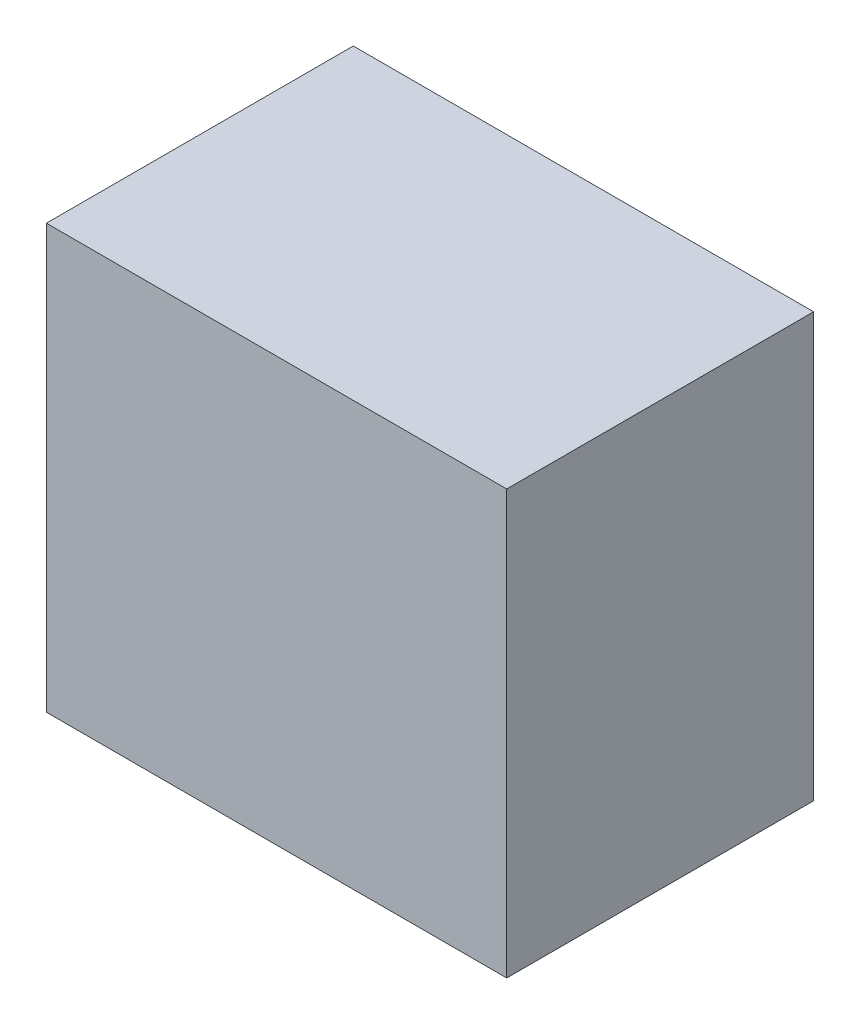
ISO-10303-21;
HEADER;
FILE_DESCRIPTION(('STEP AP214'),'2;1');
FILE_NAME('part.step','',(''),(''),'','','');
FILE_SCHEMA(('AUTOMOTIVE_DESIGN { 1 0 10303 214 1 1 1 1 }'));
ENDSEC;
DATA;
#1=APPLICATION_CONTEXT('core data for automotive mechanical design processes');
#2=APPLICATION_PROTOCOL_DEFINITION('international standard','automotive_design',2000,#1);
#3=PRODUCT_CONTEXT('',#1,'mechanical');
#4=PRODUCT('Part','Part','',(#3));
#5=PRODUCT_RELATED_PRODUCT_CATEGORY('part','',(#4));
#6=PRODUCT_DEFINITION_FORMATION('','',#4);
#7=PRODUCT_DEFINITION_CONTEXT('part definition',#1,'design');
#8=PRODUCT_DEFINITION('design','',#6,#7);
#9=PRODUCT_DEFINITION_SHAPE('','',#8);
#10=(LENGTH_UNIT() NAMED_UNIT(*) SI_UNIT(.MILLI.,.METRE.));
#11=(NAMED_UNIT(*) PLANE_ANGLE_UNIT() SI_UNIT($,.RADIAN.));
#12=(NAMED_UNIT(*) SI_UNIT($,.STERADIAN.) SOLID_ANGLE_UNIT());
#13=UNCERTAINTY_MEASURE_WITH_UNIT(LENGTH_MEASURE(1.E-05),#10,'distance_accuracy_value','');
#14=(GEOMETRIC_REPRESENTATION_CONTEXT(3) GLOBAL_UNCERTAINTY_ASSIGNED_CONTEXT((#13)) GLOBAL_UNIT_ASSIGNED_CONTEXT((#10,
#11,#12)) REPRESENTATION_CONTEXT('',''));
#15=CARTESIAN_POINT('',(0.,0.,0.));
#16=DIRECTION('',(0.,0.,1.));
#17=DIRECTION('',(1.,0.,0.));
#18=AXIS2_PLACEMENT_3D('',#15,#16,#17);
#19=CARTESIAN_POINT('',(0.,138.,-50.));
#20=DIRECTION('',(1.,0.,0.));
#21=DIRECTION('',(0.,0.,-1.));
#22=AXIS2_PLACEMENT_3D('',#19,#20,#21);
#23=PLANE('',#22);
#24=DIRECTION('',(0.,0.,1.));
#25=VECTOR('',#24,1.);
#26=CARTESIAN_POINT('',(0.,0.,-50.));
#27=LINE('',#26,#25);
#28=CARTESIAN_POINT('',(0.,0.,-50.));
#29=VERTEX_POINT('',#28);
#30=CARTESIAN_POINT('',(0.,0.,50.));
#31=VERTEX_POINT('',#30);
#32=EDGE_CURVE('E403',#29,#31,#27,.T.);
#33=ORIENTED_EDGE('',*,*,#32,.T.);
#34=DIRECTION('',(0.,-1.,0.));
#35=VECTOR('',#34,1.);
#36=CARTESIAN_POINT('',(0.,138.,50.));
#37=LINE('',#36,#35);
#38=CARTESIAN_POINT('',(0.,138.,50.));
#39=VERTEX_POINT('',#38);
#40=EDGE_CURVE('E11',#39,#31,#37,.T.);
#41=ORIENTED_EDGE('',*,*,#40,.F.);
#42=DIRECTION('',(0.,0.,1.));
#43=VECTOR('',#42,1.);
#44=CARTESIAN_POINT('',(0.,138.,-50.));
#45=LINE('',#44,#43);
#46=CARTESIAN_POINT('',(0.,138.,-50.));
#47=VERTEX_POINT('',#46);
#48=EDGE_CURVE('E421',#47,#39,#45,.T.);
#49=ORIENTED_EDGE('',*,*,#48,.F.);
#50=DIRECTION('',(0.,-1.,0.));
#51=VECTOR('',#50,1.);
#52=CARTESIAN_POINT('',(0.,138.,-50.));
#53=LINE('',#52,#51);
#54=EDGE_CURVE('E415',#47,#29,#53,.T.);
#55=ORIENTED_EDGE('',*,*,#54,.T.);
#56=EDGE_LOOP('',(#33,#41,#49,#55));
#57=FACE_BOUND('',#56,.T.);
#58=ADVANCED_FACE('F359',(#57),#23,.F.);
#59=CARTESIAN_POINT('',(0.,138.,50.));
#60=DIRECTION('',(0.,0.,-1.));
#61=DIRECTION('',(-1.,0.,0.));
#62=AXIS2_PLACEMENT_3D('',#59,#60,#61);
#63=PLANE('',#62);
#64=DIRECTION('',(1.,0.,0.));
#65=VECTOR('',#64,1.);
#66=CARTESIAN_POINT('',(0.,0.,50.));
#67=LINE('',#66,#65);
#68=CARTESIAN_POINT('',(150.,0.,50.));
#69=VERTEX_POINT('',#68);
#70=EDGE_CURVE('E399',#31,#69,#67,.T.);
#71=ORIENTED_EDGE('',*,*,#70,.T.);
#72=DIRECTION('',(0.,-1.,0.));
#73=VECTOR('',#72,1.);
#74=CARTESIAN_POINT('',(150.,138.,50.));
#75=LINE('',#74,#73);
#76=CARTESIAN_POINT('',(150.,138.,50.));
#77=VERTEX_POINT('',#76);
#78=EDGE_CURVE('E366',#77,#69,#75,.T.);
#79=ORIENTED_EDGE('',*,*,#78,.F.);
#80=DIRECTION('',(1.,0.,0.));
#81=VECTOR('',#80,1.);
#82=CARTESIAN_POINT('',(0.,138.,50.));
#83=LINE('',#82,#81);
#84=EDGE_CURVE('E411',#39,#77,#83,.T.);
#85=ORIENTED_EDGE('',*,*,#84,.F.);
#86=ORIENTED_EDGE('',*,*,#40,.T.);
#87=EDGE_LOOP('',(#71,#79,#85,#86));
#88=FACE_BOUND('',#87,.T.);
#89=ADVANCED_FACE('F410',(#88),#63,.F.);
#90=CARTESIAN_POINT('',(150.,138.,-50.));
#91=DIRECTION('',(-1.,0.,0.));
#92=DIRECTION('',(0.,0.,1.));
#93=AXIS2_PLACEMENT_3D('',#90,#91,#92);
#94=PLANE('',#93);
#95=DIRECTION('',(0.,0.,-1.));
#96=VECTOR('',#95,1.);
#97=CARTESIAN_POINT('',(150.,0.,-50.));
#98=LINE('',#97,#96);
#99=CARTESIAN_POINT('',(150.,0.,-50.));
#100=VERTEX_POINT('',#99);
#101=EDGE_CURVE('E404',#69,#100,#98,.T.);
#102=ORIENTED_EDGE('',*,*,#101,.T.);
#103=DIRECTION('',(0.,-1.,0.));
#104=VECTOR('',#103,1.);
#105=CARTESIAN_POINT('',(150.,138.,-50.));
#106=LINE('',#105,#104);
#107=CARTESIAN_POINT('',(150.,138.,-50.));
#108=VERTEX_POINT('',#107);
#109=EDGE_CURVE('E427',#108,#100,#106,.T.);
#110=ORIENTED_EDGE('',*,*,#109,.F.);
#111=DIRECTION('',(0.,0.,-1.));
#112=VECTOR('',#111,1.);
#113=CARTESIAN_POINT('',(150.,138.,-50.));
#114=LINE('',#113,#112);
#115=EDGE_CURVE('E378',#77,#108,#114,.T.);
#116=ORIENTED_EDGE('',*,*,#115,.F.);
#117=ORIENTED_EDGE('',*,*,#78,.T.);
#118=EDGE_LOOP('',(#102,#110,#116,#117));
#119=FACE_BOUND('',#118,.T.);
#120=ADVANCED_FACE('F430',(#119),#94,.F.);
#121=CARTESIAN_POINT('',(0.,138.,-50.));
#122=DIRECTION('',(0.,0.,1.));
#123=DIRECTION('',(1.,0.,0.));
#124=AXIS2_PLACEMENT_3D('',#121,#122,#123);
#125=PLANE('',#124);
#126=DIRECTION('',(-1.,0.,0.));
#127=VECTOR('',#126,1.);
#128=CARTESIAN_POINT('',(0.,0.,-50.));
#129=LINE('',#128,#127);
#130=EDGE_CURVE('E419',#100,#29,#129,.T.);
#131=ORIENTED_EDGE('',*,*,#130,.T.);
#132=ORIENTED_EDGE('',*,*,#54,.F.);
#133=DIRECTION('',(-1.,0.,0.));
#134=VECTOR('',#133,1.);
#135=CARTESIAN_POINT('',(0.,138.,-50.));
#136=LINE('',#135,#134);
#137=EDGE_CURVE('E373',#108,#47,#136,.T.);
#138=ORIENTED_EDGE('',*,*,#137,.F.);
#139=ORIENTED_EDGE('',*,*,#109,.T.);
#140=EDGE_LOOP('',(#131,#132,#138,#139));
#141=FACE_BOUND('',#140,.T.);
#142=ADVANCED_FACE('F432',(#141),#125,.F.);
#143=CARTESIAN_POINT('',(0.,138.,50.));
#144=DIRECTION('',(0.,1.,0.));
#145=DIRECTION('',(0.,0.,1.));
#146=AXIS2_PLACEMENT_3D('',#143,#144,#145);
#147=PLANE('',#146);
#148=ORIENTED_EDGE('',*,*,#48,.T.);
#149=ORIENTED_EDGE('',*,*,#84,.T.);
#150=ORIENTED_EDGE('',*,*,#115,.T.);
#151=ORIENTED_EDGE('',*,*,#137,.T.);
#152=EDGE_LOOP('',(#148,#149,#150,#151));
#153=FACE_BOUND('',#152,.T.);
#154=ADVANCED_FACE('F433',(#153),#147,.T.);
#155=CARTESIAN_POINT('',(0.,0.,50.));
#156=DIRECTION('',(0.,1.,0.));
#157=DIRECTION('',(0.,0.,1.));
#158=AXIS2_PLACEMENT_3D('',#155,#156,#157);
#159=PLANE('',#158);
#160=ORIENTED_EDGE('',*,*,#32,.F.);
#161=ORIENTED_EDGE('',*,*,#130,.F.);
#162=ORIENTED_EDGE('',*,*,#101,.F.);
#163=ORIENTED_EDGE('',*,*,#70,.F.);
#164=EDGE_LOOP('',(#160,#161,#162,#163));
#165=FACE_BOUND('',#164,.T.);
#166=ADVANCED_FACE('F400',(#165),#159,.F.);
#167=CLOSED_SHELL('',(#58,#89,#120,#142,#154,#166));
#168=MANIFOLD_SOLID_BREP('B2',#167);
#169=ADVANCED_BREP_SHAPE_REPRESENTATION('',(#18,#168),#14);
#170=SHAPE_DEFINITION_REPRESENTATION(#9,#169);
ENDSEC;
END-ISO-10303-21;
